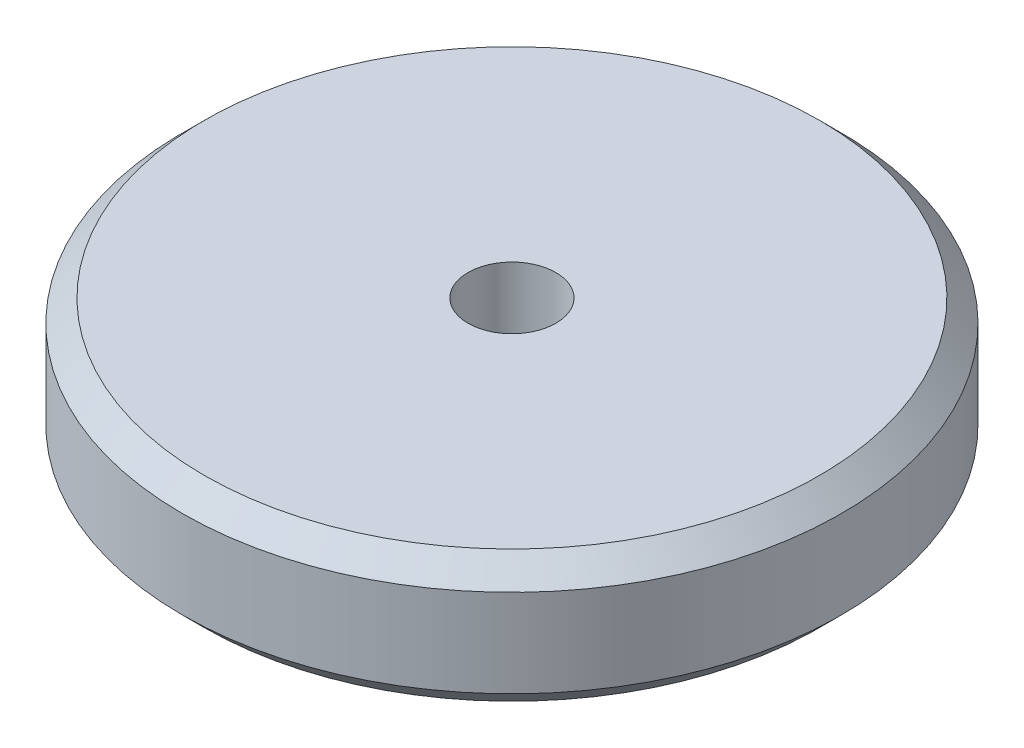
from build123d import *

# Parameters (mm, degrees)
SKETCH1_R      = 15
SKETCH1_R_2    = 2
EXTRUDE1_DEPTH = 6
CHAMFER1_SIZE  = 1


with BuildPart() as part:
    # Sketch1 → Extrude1 (new body)
    with BuildSketch(Plane(origin=(0, 0, 0), x_dir=(1, 0, 0), z_dir=(0, 1, 0))):
        with Locations(Location((0, 0, 0), (0, 0, 270))):
            Circle(SKETCH1_R)
        with Locations(Location((0, 0, 0), (0, 0, 270))):
            Circle(SKETCH1_R_2, mode=Mode.SUBTRACT)
    extrude(amount=EXTRUDE1_DEPTH)

    # Chamfer1
    chamfer1_edges = [part.edges().sort_by_distance(p)[0] for p in [
        (0, 0, -15),
        (0, 6, -15),
    ]]
    chamfer(chamfer1_edges, length=CHAMFER1_SIZE)


solid = part.part
